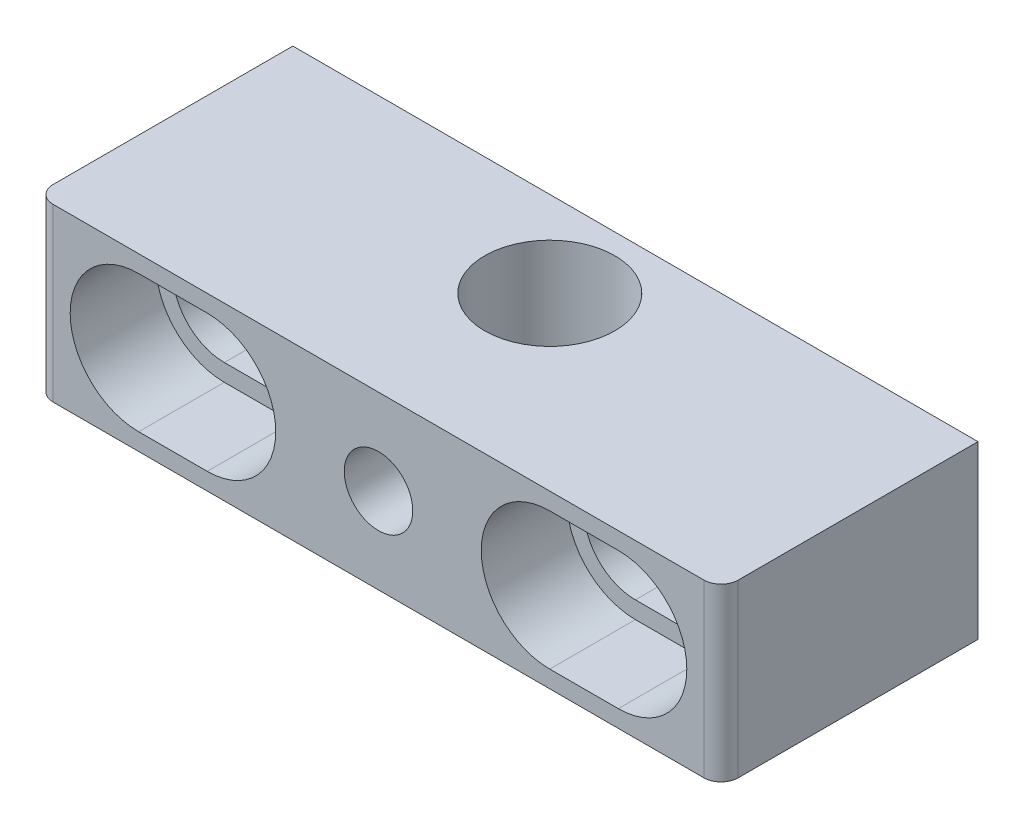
ISO-10303-21;
HEADER;
FILE_DESCRIPTION(('STEP AP214'),'2;1');
FILE_NAME('part.step','',(''),(''),'','','');
FILE_SCHEMA(('AUTOMOTIVE_DESIGN { 1 0 10303 214 1 1 1 1 }'));
ENDSEC;
DATA;
#1=APPLICATION_CONTEXT('core data for automotive mechanical design processes');
#2=APPLICATION_PROTOCOL_DEFINITION('international standard','automotive_design',2000,#1);
#3=PRODUCT_CONTEXT('',#1,'mechanical');
#4=PRODUCT('Part','Part','',(#3));
#5=PRODUCT_RELATED_PRODUCT_CATEGORY('part','',(#4));
#6=PRODUCT_DEFINITION_FORMATION('','',#4);
#7=PRODUCT_DEFINITION_CONTEXT('part definition',#1,'design');
#8=PRODUCT_DEFINITION('design','',#6,#7);
#9=PRODUCT_DEFINITION_SHAPE('','',#8);
#10=(LENGTH_UNIT() NAMED_UNIT(*) SI_UNIT(.MILLI.,.METRE.));
#11=(NAMED_UNIT(*) PLANE_ANGLE_UNIT() SI_UNIT($,.RADIAN.));
#12=(NAMED_UNIT(*) SI_UNIT($,.STERADIAN.) SOLID_ANGLE_UNIT());
#13=UNCERTAINTY_MEASURE_WITH_UNIT(LENGTH_MEASURE(1.E-05),#10,'distance_accuracy_value','');
#14=(GEOMETRIC_REPRESENTATION_CONTEXT(3) GLOBAL_UNCERTAINTY_ASSIGNED_CONTEXT((#13)) GLOBAL_UNIT_ASSIGNED_CONTEXT((#10,
#11,#12)) REPRESENTATION_CONTEXT('',''));
#15=CARTESIAN_POINT('',(0.,0.,0.));
#16=DIRECTION('',(0.,0.,1.));
#17=DIRECTION('',(1.,0.,0.));
#18=AXIS2_PLACEMENT_3D('',#15,#16,#17);
#19=CARTESIAN_POINT('',(0.,0.,6.35));
#20=DIRECTION('',(0.,0.,-1.));
#21=DIRECTION('',(-1.,0.,0.));
#22=AXIS2_PLACEMENT_3D('',#19,#20,#21);
#23=PLANE('',#22);
#24=CARTESIAN_POINT('',(0.,0.,6.35));
#25=DIRECTION('',(0.,0.,1.));
#26=DIRECTION('',(1.,0.,0.));
#27=AXIS2_PLACEMENT_3D('',#24,#25,#26);
#28=CIRCLE('',#27,2.54);
#29=CARTESIAN_POINT('',(2.54,0.,6.35));
#30=VERTEX_POINT('',#29);
#31=EDGE_CURVE('E667',#30,#30,#28,.T.);
#32=ORIENTED_EDGE('',*,*,#31,.F.);
#33=EDGE_LOOP('',(#32));
#34=FACE_BOUND('',#33,.T.);
#35=CARTESIAN_POINT('',(-17.78,0.,6.35));
#36=DIRECTION('',(0.,0.,1.));
#37=DIRECTION('',(1.,0.,0.));
#38=AXIS2_PLACEMENT_3D('',#35,#36,#37);
#39=CIRCLE('',#38,5.08);
#40=CARTESIAN_POINT('',(-17.78,5.08,6.35));
#41=VERTEX_POINT('',#40);
#42=CARTESIAN_POINT('',(-17.78,-5.08,6.35));
#43=VERTEX_POINT('',#42);
#44=EDGE_CURVE('E316',#41,#43,#39,.T.);
#45=ORIENTED_EDGE('',*,*,#44,.F.);
#46=DIRECTION('',(-1.,0.,0.));
#47=VECTOR('',#46,1.);
#48=CARTESIAN_POINT('',(-17.78,5.08,6.35));
#49=LINE('',#48,#47);
#50=CARTESIAN_POINT('',(-12.7,5.07999999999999,6.35));
#51=VERTEX_POINT('',#50);
#52=EDGE_CURVE('E324',#51,#41,#49,.T.);
#53=ORIENTED_EDGE('',*,*,#52,.F.);
#54=CARTESIAN_POINT('',(-12.7,0.,6.35));
#55=DIRECTION('',(0.,0.,1.));
#56=DIRECTION('',(1.,0.,0.));
#57=AXIS2_PLACEMENT_3D('',#54,#55,#56);
#58=CIRCLE('',#57,5.08);
#59=CARTESIAN_POINT('',(-12.7,-5.08,6.35));
#60=VERTEX_POINT('',#59);
#61=EDGE_CURVE('E321',#60,#51,#58,.T.);
#62=ORIENTED_EDGE('',*,*,#61,.F.);
#63=DIRECTION('',(1.,0.,0.));
#64=VECTOR('',#63,1.);
#65=CARTESIAN_POINT('',(-17.78,-5.08,6.35));
#66=LINE('',#65,#64);
#67=EDGE_CURVE('E318',#43,#60,#66,.T.);
#68=ORIENTED_EDGE('',*,*,#67,.F.);
#69=EDGE_LOOP('',(#45,#53,#62,#68));
#70=FACE_BOUND('',#69,.T.);
#71=DIRECTION('',(-1.,0.,0.));
#72=VECTOR('',#71,1.);
#73=CARTESIAN_POINT('',(-25.4,6.35,6.35));
#74=LINE('',#73,#72);
#75=CARTESIAN_POINT('',(24.13,6.35,6.35));
#76=VERTEX_POINT('',#75);
#77=CARTESIAN_POINT('',(-24.13,6.35,6.35));
#78=VERTEX_POINT('',#77);
#79=EDGE_CURVE('E345',#76,#78,#74,.T.);
#80=ORIENTED_EDGE('',*,*,#79,.T.);
#81=DIRECTION('',(0.,-1.,0.));
#82=VECTOR('',#81,1.);
#83=CARTESIAN_POINT('',(-24.13,0.,6.35));
#84=LINE('',#83,#82);
#85=CARTESIAN_POINT('',(-24.13,-6.35,6.35));
#86=VERTEX_POINT('',#85);
#87=EDGE_CURVE('E362',#78,#86,#84,.T.);
#88=ORIENTED_EDGE('',*,*,#87,.T.);
#89=DIRECTION('',(1.,0.,0.));
#90=VECTOR('',#89,1.);
#91=CARTESIAN_POINT('',(-25.4,-6.35,6.35));
#92=LINE('',#91,#90);
#93=CARTESIAN_POINT('',(24.13,-6.35,6.35));
#94=VERTEX_POINT('',#93);
#95=EDGE_CURVE('E348',#86,#94,#92,.T.);
#96=ORIENTED_EDGE('',*,*,#95,.T.);
#97=DIRECTION('',(0.,1.,0.));
#98=VECTOR('',#97,1.);
#99=CARTESIAN_POINT('',(24.13,0.,6.35));
#100=LINE('',#99,#98);
#101=EDGE_CURVE('E359',#94,#76,#100,.T.);
#102=ORIENTED_EDGE('',*,*,#101,.T.);
#103=EDGE_LOOP('',(#80,#88,#96,#102));
#104=FACE_BOUND('',#103,.T.);
#105=CARTESIAN_POINT('',(17.78,0.,6.35));
#106=DIRECTION('',(0.,0.,1.));
#107=DIRECTION('',(-1.,0.,0.));
#108=AXIS2_PLACEMENT_3D('',#105,#106,#107);
#109=CIRCLE('',#108,5.08);
#110=CARTESIAN_POINT('',(17.78,-5.08,6.35));
#111=VERTEX_POINT('',#110);
#112=CARTESIAN_POINT('',(17.78,5.08,6.35));
#113=VERTEX_POINT('',#112);
#114=EDGE_CURVE('E286',#111,#113,#109,.T.);
#115=ORIENTED_EDGE('',*,*,#114,.F.);
#116=DIRECTION('',(1.,0.,0.));
#117=VECTOR('',#116,1.);
#118=CARTESIAN_POINT('',(17.78,-5.08,6.35));
#119=LINE('',#118,#117);
#120=CARTESIAN_POINT('',(12.7,-5.08,6.35));
#121=VERTEX_POINT('',#120);
#122=EDGE_CURVE('E294',#121,#111,#119,.T.);
#123=ORIENTED_EDGE('',*,*,#122,.F.);
#124=CARTESIAN_POINT('',(12.7,0.,6.35));
#125=DIRECTION('',(0.,0.,1.));
#126=DIRECTION('',(-1.,0.,0.));
#127=AXIS2_PLACEMENT_3D('',#124,#125,#126);
#128=CIRCLE('',#127,5.08);
#129=CARTESIAN_POINT('',(12.7,5.07999999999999,6.35));
#130=VERTEX_POINT('',#129);
#131=EDGE_CURVE('E291',#130,#121,#128,.T.);
#132=ORIENTED_EDGE('',*,*,#131,.F.);
#133=DIRECTION('',(-1.,0.,0.));
#134=VECTOR('',#133,1.);
#135=CARTESIAN_POINT('',(17.78,5.08,6.35));
#136=LINE('',#135,#134);
#137=EDGE_CURVE('E288',#113,#130,#136,.T.);
#138=ORIENTED_EDGE('',*,*,#137,.F.);
#139=EDGE_LOOP('',(#115,#123,#132,#138));
#140=FACE_BOUND('',#139,.T.);
#141=ADVANCED_FACE('F44',(#34,#70,#104,#140),#23,.F.);
#142=CARTESIAN_POINT('',(25.4,-6.35,6.35));
#143=DIRECTION('',(-1.,0.,0.));
#144=DIRECTION('',(0.,0.,1.));
#145=AXIS2_PLACEMENT_3D('',#142,#143,#144);
#146=PLANE('',#145);
#147=DIRECTION('',(0.,0.,-1.));
#148=VECTOR('',#147,1.);
#149=CARTESIAN_POINT('',(25.4,6.35,6.35));
#150=LINE('',#149,#148);
#151=CARTESIAN_POINT('',(25.4,6.35,5.08));
#152=VERTEX_POINT('',#151);
#153=CARTESIAN_POINT('',(25.4,6.35,-12.7));
#154=VERTEX_POINT('',#153);
#155=EDGE_CURVE('E357',#152,#154,#150,.T.);
#156=ORIENTED_EDGE('',*,*,#155,.F.);
#157=DIRECTION('',(0.,1.,0.));
#158=VECTOR('',#157,1.);
#159=CARTESIAN_POINT('',(25.4,-6.35,5.08));
#160=LINE('',#159,#158);
#161=CARTESIAN_POINT('',(25.4,-6.35,5.08));
#162=VERTEX_POINT('',#161);
#163=EDGE_CURVE('E13',#152,#162,#160,.F.);
#164=ORIENTED_EDGE('',*,*,#163,.T.);
#165=DIRECTION('',(0.,0.,-1.));
#166=VECTOR('',#165,1.);
#167=CARTESIAN_POINT('',(25.4,-6.35,6.35));
#168=LINE('',#167,#166);
#169=CARTESIAN_POINT('',(25.4,-6.35,-12.7));
#170=VERTEX_POINT('',#169);
#171=EDGE_CURVE('E351',#162,#170,#168,.T.);
#172=ORIENTED_EDGE('',*,*,#171,.T.);
#173=DIRECTION('',(0.,-1.,0.));
#174=VECTOR('',#173,1.);
#175=CARTESIAN_POINT('',(25.4,-6.35,-12.7));
#176=LINE('',#175,#174);
#177=EDGE_CURVE('E279',#154,#170,#176,.T.);
#178=ORIENTED_EDGE('',*,*,#177,.F.);
#179=EDGE_LOOP('',(#156,#164,#172,#178));
#180=FACE_BOUND('',#179,.T.);
#181=ADVANCED_FACE('F393',(#180),#146,.F.);
#182=CARTESIAN_POINT('',(-25.4,6.35,6.35));
#183=DIRECTION('',(0.,-1.,0.));
#184=DIRECTION('',(0.,0.,-1.));
#185=AXIS2_PLACEMENT_3D('',#182,#183,#184);
#186=PLANE('',#185);
#187=CARTESIAN_POINT('',(0.,6.35,-6.35));
#188=DIRECTION('',(0.,1.,0.));
#189=DIRECTION('',(0.,0.,1.));
#190=AXIS2_PLACEMENT_3D('',#187,#188,#189);
#191=CIRCLE('',#190,4.826);
#192=CARTESIAN_POINT('',(0.,6.35,-1.524));
#193=VERTEX_POINT('',#192);
#194=EDGE_CURVE('E670',#193,#193,#191,.T.);
#195=ORIENTED_EDGE('',*,*,#194,.F.);
#196=EDGE_LOOP('',(#195));
#197=FACE_BOUND('',#196,.T.);
#198=DIRECTION('',(0.,0.,-1.));
#199=VECTOR('',#198,1.);
#200=CARTESIAN_POINT('',(-25.4,6.35,6.35));
#201=LINE('',#200,#199);
#202=CARTESIAN_POINT('',(-25.4,6.35,5.08));
#203=VERTEX_POINT('',#202);
#204=CARTESIAN_POINT('',(-25.4,6.35,-12.7));
#205=VERTEX_POINT('',#204);
#206=EDGE_CURVE('E355',#203,#205,#201,.T.);
#207=ORIENTED_EDGE('',*,*,#206,.F.);
#208=CARTESIAN_POINT('',(-24.13,6.35,5.08));
#209=DIRECTION('',(0.,-1.,0.));
#210=DIRECTION('',(0.,0.,-1.));
#211=AXIS2_PLACEMENT_3D('',#208,#209,#210);
#212=CIRCLE('',#211,1.27);
#213=EDGE_CURVE('E57',#203,#78,#212,.F.);
#214=ORIENTED_EDGE('',*,*,#213,.T.);
#215=ORIENTED_EDGE('',*,*,#79,.F.);
#216=CARTESIAN_POINT('',(24.13,6.35,5.08));
#217=DIRECTION('',(0.,-1.,0.));
#218=DIRECTION('',(0.,0.,-1.));
#219=AXIS2_PLACEMENT_3D('',#216,#217,#218);
#220=CIRCLE('',#219,1.27);
#221=EDGE_CURVE('E64',#76,#152,#220,.F.);
#222=ORIENTED_EDGE('',*,*,#221,.T.);
#223=ORIENTED_EDGE('',*,*,#155,.T.);
#224=DIRECTION('',(1.,0.,0.));
#225=VECTOR('',#224,1.);
#226=CARTESIAN_POINT('',(25.4,6.35,-12.7));
#227=LINE('',#226,#225);
#228=EDGE_CURVE('E276',#205,#154,#227,.T.);
#229=ORIENTED_EDGE('',*,*,#228,.F.);
#230=EDGE_LOOP('',(#207,#214,#215,#222,#223,#229));
#231=FACE_BOUND('',#230,.T.);
#232=ADVANCED_FACE('F372',(#197,#231),#186,.F.);
#233=CARTESIAN_POINT('',(-25.4,-6.35,6.35));
#234=DIRECTION('',(1.,0.,0.));
#235=DIRECTION('',(0.,0.,-1.));
#236=AXIS2_PLACEMENT_3D('',#233,#234,#235);
#237=PLANE('',#236);
#238=DIRECTION('',(0.,0.,-1.));
#239=VECTOR('',#238,1.);
#240=CARTESIAN_POINT('',(-25.4,-6.35,6.35));
#241=LINE('',#240,#239);
#242=CARTESIAN_POINT('',(-25.4,-6.35,5.08));
#243=VERTEX_POINT('',#242);
#244=CARTESIAN_POINT('',(-25.4,-6.35,-12.7));
#245=VERTEX_POINT('',#244);
#246=EDGE_CURVE('E353',#243,#245,#241,.T.);
#247=ORIENTED_EDGE('',*,*,#246,.F.);
#248=DIRECTION('',(0.,-1.,0.));
#249=VECTOR('',#248,1.);
#250=CARTESIAN_POINT('',(-25.4,-6.35,5.08));
#251=LINE('',#250,#249);
#252=EDGE_CURVE('E72',#243,#203,#251,.F.);
#253=ORIENTED_EDGE('',*,*,#252,.T.);
#254=ORIENTED_EDGE('',*,*,#206,.T.);
#255=DIRECTION('',(0.,1.,0.));
#256=VECTOR('',#255,1.);
#257=CARTESIAN_POINT('',(-25.4,-6.35,-12.7));
#258=LINE('',#257,#256);
#259=EDGE_CURVE('E273',#245,#205,#258,.T.);
#260=ORIENTED_EDGE('',*,*,#259,.F.);
#261=EDGE_LOOP('',(#247,#253,#254,#260));
#262=FACE_BOUND('',#261,.T.);
#263=ADVANCED_FACE('F385',(#262),#237,.F.);
#264=CARTESIAN_POINT('',(-25.4,-6.35,6.35));
#265=DIRECTION('',(0.,1.,0.));
#266=DIRECTION('',(0.,0.,1.));
#267=AXIS2_PLACEMENT_3D('',#264,#265,#266);
#268=PLANE('',#267);
#269=CARTESIAN_POINT('',(0.,-6.35,-6.35));
#270=DIRECTION('',(0.,1.,0.));
#271=DIRECTION('',(0.,0.,1.));
#272=AXIS2_PLACEMENT_3D('',#269,#270,#271);
#273=CIRCLE('',#272,4.826);
#274=CARTESIAN_POINT('',(0.,-6.35,-1.524));
#275=VERTEX_POINT('',#274);
#276=EDGE_CURVE('E232',#275,#275,#273,.T.);
#277=ORIENTED_EDGE('',*,*,#276,.T.);
#278=EDGE_LOOP('',(#277));
#279=FACE_BOUND('',#278,.T.);
#280=ORIENTED_EDGE('',*,*,#95,.F.);
#281=CARTESIAN_POINT('',(-24.13,-6.35,5.08));
#282=DIRECTION('',(0.,1.,0.));
#283=DIRECTION('',(0.,0.,1.));
#284=AXIS2_PLACEMENT_3D('',#281,#282,#283);
#285=CIRCLE('',#284,1.27);
#286=EDGE_CURVE('E367',#86,#243,#285,.F.);
#287=ORIENTED_EDGE('',*,*,#286,.T.);
#288=ORIENTED_EDGE('',*,*,#246,.T.);
#289=DIRECTION('',(-1.,0.,0.));
#290=VECTOR('',#289,1.);
#291=CARTESIAN_POINT('',(25.4,-6.35,-12.7));
#292=LINE('',#291,#290);
#293=EDGE_CURVE('E282',#170,#245,#292,.T.);
#294=ORIENTED_EDGE('',*,*,#293,.F.);
#295=ORIENTED_EDGE('',*,*,#171,.F.);
#296=CARTESIAN_POINT('',(24.13,-6.35,5.08));
#297=DIRECTION('',(0.,1.,0.));
#298=DIRECTION('',(0.,0.,1.));
#299=AXIS2_PLACEMENT_3D('',#296,#297,#298);
#300=CIRCLE('',#299,1.27);
#301=EDGE_CURVE('E365',#162,#94,#300,.F.);
#302=ORIENTED_EDGE('',*,*,#301,.T.);
#303=EDGE_LOOP('',(#280,#287,#288,#294,#295,#302));
#304=FACE_BOUND('',#303,.T.);
#305=ADVANCED_FACE('F382',(#279,#304),#268,.F.);
#306=CARTESIAN_POINT('',(-17.78,0.,6.35));
#307=DIRECTION('',(0.,0.,-1.));
#308=DIRECTION('',(-1.,0.,0.));
#309=AXIS2_PLACEMENT_3D('',#306,#307,#308);
#310=CYLINDRICAL_SURFACE('',#309,5.08);
#311=CARTESIAN_POINT('',(-17.78,0.,0.));
#312=DIRECTION('',(0.,0.,1.));
#313=DIRECTION('',(1.,0.,0.));
#314=AXIS2_PLACEMENT_3D('',#311,#312,#313);
#315=CIRCLE('',#314,5.08);
#316=CARTESIAN_POINT('',(-17.78,5.08,0.));
#317=VERTEX_POINT('',#316);
#318=CARTESIAN_POINT('',(-17.78,-5.08,0.));
#319=VERTEX_POINT('',#318);
#320=EDGE_CURVE('E315',#317,#319,#315,.T.);
#321=ORIENTED_EDGE('',*,*,#320,.F.);
#322=DIRECTION('',(0.,0.,-1.));
#323=VECTOR('',#322,1.);
#324=CARTESIAN_POINT('',(-17.78,5.08,6.35));
#325=LINE('',#324,#323);
#326=EDGE_CURVE('E326',#41,#317,#325,.T.);
#327=ORIENTED_EDGE('',*,*,#326,.F.);
#328=ORIENTED_EDGE('',*,*,#44,.T.);
#329=DIRECTION('',(0.,0.,-1.));
#330=VECTOR('',#329,1.);
#331=CARTESIAN_POINT('',(-17.78,-5.08,6.35));
#332=LINE('',#331,#330);
#333=EDGE_CURVE('E342',#43,#319,#332,.T.);
#334=ORIENTED_EDGE('',*,*,#333,.T.);
#335=EDGE_LOOP('',(#321,#327,#328,#334));
#336=FACE_BOUND('',#335,.T.);
#337=ADVANCED_FACE('F478',(#336),#310,.F.);
#338=CARTESIAN_POINT('',(-17.78,-5.08,6.35));
#339=DIRECTION('',(0.,1.,0.));
#340=DIRECTION('',(0.,0.,1.));
#341=AXIS2_PLACEMENT_3D('',#338,#339,#340);
#342=PLANE('',#341);
#343=DIRECTION('',(1.,0.,0.));
#344=VECTOR('',#343,1.);
#345=CARTESIAN_POINT('',(-17.78,-5.08,0.));
#346=LINE('',#345,#344);
#347=CARTESIAN_POINT('',(-12.7,-5.08,0.));
#348=VERTEX_POINT('',#347);
#349=EDGE_CURVE('E329',#319,#348,#346,.T.);
#350=ORIENTED_EDGE('',*,*,#349,.F.);
#351=ORIENTED_EDGE('',*,*,#333,.F.);
#352=ORIENTED_EDGE('',*,*,#67,.T.);
#353=DIRECTION('',(0.,0.,-1.));
#354=VECTOR('',#353,1.);
#355=CARTESIAN_POINT('',(-12.7,-5.08,6.35));
#356=LINE('',#355,#354);
#357=EDGE_CURVE('E340',#60,#348,#356,.T.);
#358=ORIENTED_EDGE('',*,*,#357,.T.);
#359=EDGE_LOOP('',(#350,#351,#352,#358));
#360=FACE_BOUND('',#359,.T.);
#361=ADVANCED_FACE('F474',(#360),#342,.T.);
#362=CARTESIAN_POINT('',(-12.7,0.,6.35));
#363=DIRECTION('',(0.,0.,-1.));
#364=DIRECTION('',(-1.,0.,0.));
#365=AXIS2_PLACEMENT_3D('',#362,#363,#364);
#366=CYLINDRICAL_SURFACE('',#365,5.08);
#367=CARTESIAN_POINT('',(-12.7,0.,0.));
#368=DIRECTION('',(0.,0.,1.));
#369=DIRECTION('',(1.,0.,0.));
#370=AXIS2_PLACEMENT_3D('',#367,#368,#369);
#371=CIRCLE('',#370,5.08);
#372=CARTESIAN_POINT('',(-12.7,5.07999999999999,0.));
#373=VERTEX_POINT('',#372);
#374=EDGE_CURVE('E332',#348,#373,#371,.T.);
#375=ORIENTED_EDGE('',*,*,#374,.F.);
#376=ORIENTED_EDGE('',*,*,#357,.F.);
#377=ORIENTED_EDGE('',*,*,#61,.T.);
#378=DIRECTION('',(0.,0.,-1.));
#379=VECTOR('',#378,1.);
#380=CARTESIAN_POINT('',(-12.7,5.07999999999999,6.35));
#381=LINE('',#380,#379);
#382=EDGE_CURVE('E338',#51,#373,#381,.T.);
#383=ORIENTED_EDGE('',*,*,#382,.T.);
#384=EDGE_LOOP('',(#375,#376,#377,#383));
#385=FACE_BOUND('',#384,.T.);
#386=ADVANCED_FACE('F470',(#385),#366,.F.);
#387=CARTESIAN_POINT('',(-17.78,5.08,6.35));
#388=DIRECTION('',(0.,-1.,0.));
#389=DIRECTION('',(1.,0.,0.));
#390=AXIS2_PLACEMENT_3D('',#387,#388,#389);
#391=PLANE('',#390);
#392=DIRECTION('',(-1.,0.,0.));
#393=VECTOR('',#392,1.);
#394=CARTESIAN_POINT('',(-17.78,5.08,0.));
#395=LINE('',#394,#393);
#396=EDGE_CURVE('E319',#373,#317,#395,.T.);
#397=ORIENTED_EDGE('',*,*,#396,.F.);
#398=ORIENTED_EDGE('',*,*,#382,.F.);
#399=ORIENTED_EDGE('',*,*,#52,.T.);
#400=ORIENTED_EDGE('',*,*,#326,.T.);
#401=EDGE_LOOP('',(#397,#398,#399,#400));
#402=FACE_BOUND('',#401,.T.);
#403=ADVANCED_FACE('F466',(#402),#391,.T.);
#404=CARTESIAN_POINT('',(17.78,0.,6.35));
#405=DIRECTION('',(0.,0.,-1.));
#406=DIRECTION('',(-1.,0.,0.));
#407=AXIS2_PLACEMENT_3D('',#404,#405,#406);
#408=CYLINDRICAL_SURFACE('',#407,5.08);
#409=CARTESIAN_POINT('',(17.78,0.,0.));
#410=DIRECTION('',(0.,0.,1.));
#411=DIRECTION('',(-1.,0.,0.));
#412=AXIS2_PLACEMENT_3D('',#409,#410,#411);
#413=CIRCLE('',#412,5.08);
#414=CARTESIAN_POINT('',(17.78,-5.08,0.));
#415=VERTEX_POINT('',#414);
#416=CARTESIAN_POINT('',(17.78,5.08,0.));
#417=VERTEX_POINT('',#416);
#418=EDGE_CURVE('E285',#415,#417,#413,.T.);
#419=ORIENTED_EDGE('',*,*,#418,.F.);
#420=DIRECTION('',(0.,0.,-1.));
#421=VECTOR('',#420,1.);
#422=CARTESIAN_POINT('',(17.78,-5.08,6.35));
#423=LINE('',#422,#421);
#424=EDGE_CURVE('E296',#111,#415,#423,.T.);
#425=ORIENTED_EDGE('',*,*,#424,.F.);
#426=ORIENTED_EDGE('',*,*,#114,.T.);
#427=DIRECTION('',(0.,0.,-1.));
#428=VECTOR('',#427,1.);
#429=CARTESIAN_POINT('',(17.78,5.08,6.35));
#430=LINE('',#429,#428);
#431=EDGE_CURVE('E312',#113,#417,#430,.T.);
#432=ORIENTED_EDGE('',*,*,#431,.T.);
#433=EDGE_LOOP('',(#419,#425,#426,#432));
#434=FACE_BOUND('',#433,.T.);
#435=ADVANCED_FACE('F462',(#434),#408,.F.);
#436=CARTESIAN_POINT('',(17.78,5.08,6.35));
#437=DIRECTION('',(0.,-1.,0.));
#438=DIRECTION('',(1.,0.,0.));
#439=AXIS2_PLACEMENT_3D('',#436,#437,#438);
#440=PLANE('',#439);
#441=DIRECTION('',(-1.,0.,0.));
#442=VECTOR('',#441,1.);
#443=CARTESIAN_POINT('',(17.78,5.08,0.));
#444=LINE('',#443,#442);
#445=CARTESIAN_POINT('',(12.7,5.07999999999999,0.));
#446=VERTEX_POINT('',#445);
#447=EDGE_CURVE('E299',#417,#446,#444,.T.);
#448=ORIENTED_EDGE('',*,*,#447,.F.);
#449=ORIENTED_EDGE('',*,*,#431,.F.);
#450=ORIENTED_EDGE('',*,*,#137,.T.);
#451=DIRECTION('',(0.,0.,-1.));
#452=VECTOR('',#451,1.);
#453=CARTESIAN_POINT('',(12.7,5.07999999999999,6.35));
#454=LINE('',#453,#452);
#455=EDGE_CURVE('E310',#130,#446,#454,.T.);
#456=ORIENTED_EDGE('',*,*,#455,.T.);
#457=EDGE_LOOP('',(#448,#449,#450,#456));
#458=FACE_BOUND('',#457,.T.);
#459=ADVANCED_FACE('F458',(#458),#440,.T.);
#460=CARTESIAN_POINT('',(12.7,0.,6.35));
#461=DIRECTION('',(0.,0.,-1.));
#462=DIRECTION('',(-1.,0.,0.));
#463=AXIS2_PLACEMENT_3D('',#460,#461,#462);
#464=CYLINDRICAL_SURFACE('',#463,5.08);
#465=CARTESIAN_POINT('',(12.7,0.,0.));
#466=DIRECTION('',(0.,0.,1.));
#467=DIRECTION('',(-1.,0.,0.));
#468=AXIS2_PLACEMENT_3D('',#465,#466,#467);
#469=CIRCLE('',#468,5.08);
#470=CARTESIAN_POINT('',(12.7,-5.08,0.));
#471=VERTEX_POINT('',#470);
#472=EDGE_CURVE('E302',#446,#471,#469,.T.);
#473=ORIENTED_EDGE('',*,*,#472,.F.);
#474=ORIENTED_EDGE('',*,*,#455,.F.);
#475=ORIENTED_EDGE('',*,*,#131,.T.);
#476=DIRECTION('',(0.,0.,-1.));
#477=VECTOR('',#476,1.);
#478=CARTESIAN_POINT('',(12.7,-5.08,6.35));
#479=LINE('',#478,#477);
#480=EDGE_CURVE('E308',#121,#471,#479,.T.);
#481=ORIENTED_EDGE('',*,*,#480,.T.);
#482=EDGE_LOOP('',(#473,#474,#475,#481));
#483=FACE_BOUND('',#482,.T.);
#484=ADVANCED_FACE('F454',(#483),#464,.F.);
#485=CARTESIAN_POINT('',(17.78,-5.08,6.35));
#486=DIRECTION('',(0.,1.,0.));
#487=DIRECTION('',(0.,0.,1.));
#488=AXIS2_PLACEMENT_3D('',#485,#486,#487);
#489=PLANE('',#488);
#490=DIRECTION('',(1.,0.,0.));
#491=VECTOR('',#490,1.);
#492=CARTESIAN_POINT('',(17.78,-5.08,0.));
#493=LINE('',#492,#491);
#494=EDGE_CURVE('E289',#471,#415,#493,.T.);
#495=ORIENTED_EDGE('',*,*,#494,.F.);
#496=ORIENTED_EDGE('',*,*,#480,.F.);
#497=ORIENTED_EDGE('',*,*,#122,.T.);
#498=ORIENTED_EDGE('',*,*,#424,.T.);
#499=EDGE_LOOP('',(#495,#496,#497,#498));
#500=FACE_BOUND('',#499,.T.);
#501=ADVANCED_FACE('F451',(#500),#489,.T.);
#502=CARTESIAN_POINT('',(0.,0.,0.));
#503=DIRECTION('',(0.,0.,1.));
#504=DIRECTION('',(1.,0.,0.));
#505=AXIS2_PLACEMENT_3D('',#502,#503,#504);
#506=PLANE('',#505);
#507=ORIENTED_EDGE('',*,*,#396,.T.);
#508=ORIENTED_EDGE('',*,*,#320,.T.);
#509=ORIENTED_EDGE('',*,*,#349,.T.);
#510=ORIENTED_EDGE('',*,*,#374,.T.);
#511=EDGE_LOOP('',(#507,#508,#509,#510));
#512=FACE_BOUND('',#511,.T.);
#513=DIRECTION('',(-1.,0.,0.));
#514=VECTOR('',#513,1.);
#515=CARTESIAN_POINT('',(-17.78,-3.81,0.));
#516=LINE('',#515,#514);
#517=CARTESIAN_POINT('',(-12.7,-3.81,0.));
#518=VERTEX_POINT('',#517);
#519=CARTESIAN_POINT('',(-17.78,-3.81,0.));
#520=VERTEX_POINT('',#519);
#521=EDGE_CURVE('E210',#518,#520,#516,.T.);
#522=ORIENTED_EDGE('',*,*,#521,.T.);
#523=CARTESIAN_POINT('',(-17.78,0.,0.));
#524=DIRECTION('',(0.,0.,-1.));
#525=DIRECTION('',(1.,0.,0.));
#526=AXIS2_PLACEMENT_3D('',#523,#524,#525);
#527=CIRCLE('',#526,3.81);
#528=CARTESIAN_POINT('',(-17.78,3.81,0.));
#529=VERTEX_POINT('',#528);
#530=EDGE_CURVE('E230',#520,#529,#527,.T.);
#531=ORIENTED_EDGE('',*,*,#530,.T.);
#532=DIRECTION('',(1.,0.,0.));
#533=VECTOR('',#532,1.);
#534=CARTESIAN_POINT('',(-17.78,3.81,0.));
#535=LINE('',#534,#533);
#536=CARTESIAN_POINT('',(-12.7,3.81,0.));
#537=VERTEX_POINT('',#536);
#538=EDGE_CURVE('E216',#529,#537,#535,.T.);
#539=ORIENTED_EDGE('',*,*,#538,.T.);
#540=CARTESIAN_POINT('',(-12.7,0.,0.));
#541=DIRECTION('',(0.,0.,-1.));
#542=DIRECTION('',(1.,0.,0.));
#543=AXIS2_PLACEMENT_3D('',#540,#541,#542);
#544=CIRCLE('',#543,3.81);
#545=EDGE_CURVE('E234',#537,#518,#544,.T.);
#546=ORIENTED_EDGE('',*,*,#545,.T.);
#547=EDGE_LOOP('',(#522,#531,#539,#546));
#548=FACE_BOUND('',#547,.T.);
#549=ADVANCED_FACE('F446',(#512,#548),#506,.T.);
#550=CARTESIAN_POINT('',(0.,0.,-12.7));
#551=DIRECTION('',(0.,0.,1.));
#552=DIRECTION('',(1.,0.,0.));
#553=AXIS2_PLACEMENT_3D('',#550,#551,#552);
#554=PLANE('',#553);
#555=CARTESIAN_POINT('',(17.78,0.,-12.7));
#556=DIRECTION('',(0.,0.,-1.));
#557=DIRECTION('',(-1.,0.,0.));
#558=AXIS2_PLACEMENT_3D('',#555,#556,#557);
#559=CIRCLE('',#558,3.81);
#560=CARTESIAN_POINT('',(17.78,3.81,-12.7));
#561=VERTEX_POINT('',#560);
#562=CARTESIAN_POINT('',(17.78,-3.81,-12.7));
#563=VERTEX_POINT('',#562);
#564=EDGE_CURVE('E243',#561,#563,#559,.T.);
#565=ORIENTED_EDGE('',*,*,#564,.F.);
#566=DIRECTION('',(1.,0.,0.));
#567=VECTOR('',#566,1.);
#568=CARTESIAN_POINT('',(17.78,3.81,-12.7));
#569=LINE('',#568,#567);
#570=CARTESIAN_POINT('',(12.7,3.81,-12.7));
#571=VERTEX_POINT('',#570);
#572=EDGE_CURVE('E251',#571,#561,#569,.T.);
#573=ORIENTED_EDGE('',*,*,#572,.F.);
#574=CARTESIAN_POINT('',(12.7,0.,-12.7));
#575=DIRECTION('',(0.,0.,-1.));
#576=DIRECTION('',(-1.,0.,0.));
#577=AXIS2_PLACEMENT_3D('',#574,#575,#576);
#578=CIRCLE('',#577,3.81);
#579=CARTESIAN_POINT('',(12.7,-3.81,-12.7));
#580=VERTEX_POINT('',#579);
#581=EDGE_CURVE('E248',#580,#571,#578,.T.);
#582=ORIENTED_EDGE('',*,*,#581,.F.);
#583=DIRECTION('',(-1.,0.,0.));
#584=VECTOR('',#583,1.);
#585=CARTESIAN_POINT('',(17.78,-3.81,-12.7));
#586=LINE('',#585,#584);
#587=EDGE_CURVE('E245',#563,#580,#586,.T.);
#588=ORIENTED_EDGE('',*,*,#587,.F.);
#589=EDGE_LOOP('',(#565,#573,#582,#588));
#590=FACE_BOUND('',#589,.T.);
#591=ORIENTED_EDGE('',*,*,#259,.T.);
#592=ORIENTED_EDGE('',*,*,#228,.T.);
#593=ORIENTED_EDGE('',*,*,#177,.T.);
#594=ORIENTED_EDGE('',*,*,#293,.T.);
#595=EDGE_LOOP('',(#591,#592,#593,#594));
#596=FACE_BOUND('',#595,.T.);
#597=CARTESIAN_POINT('',(-17.78,0.,-12.7));
#598=DIRECTION('',(0.,0.,-1.));
#599=DIRECTION('',(1.,0.,0.));
#600=AXIS2_PLACEMENT_3D('',#597,#598,#599);
#601=CIRCLE('',#600,3.81);
#602=CARTESIAN_POINT('',(-17.78,-3.81,-12.7));
#603=VERTEX_POINT('',#602);
#604=CARTESIAN_POINT('',(-17.78,3.81,-12.7));
#605=VERTEX_POINT('',#604);
#606=EDGE_CURVE('E199',#603,#605,#601,.T.);
#607=ORIENTED_EDGE('',*,*,#606,.F.);
#608=DIRECTION('',(-1.,0.,0.));
#609=VECTOR('',#608,1.);
#610=CARTESIAN_POINT('',(-17.78,-3.81,-12.7));
#611=LINE('',#610,#609);
#612=CARTESIAN_POINT('',(-12.7,-3.81,-12.7));
#613=VERTEX_POINT('',#612);
#614=EDGE_CURVE('E225',#613,#603,#611,.T.);
#615=ORIENTED_EDGE('',*,*,#614,.F.);
#616=CARTESIAN_POINT('',(-12.7,0.,-12.7));
#617=DIRECTION('',(0.,0.,-1.));
#618=DIRECTION('',(1.,0.,0.));
#619=AXIS2_PLACEMENT_3D('',#616,#617,#618);
#620=CIRCLE('',#619,3.81);
#621=CARTESIAN_POINT('',(-12.7,3.81,-12.7));
#622=VERTEX_POINT('',#621);
#623=EDGE_CURVE('E223',#622,#613,#620,.T.);
#624=ORIENTED_EDGE('',*,*,#623,.F.);
#625=DIRECTION('',(1.,0.,0.));
#626=VECTOR('',#625,1.);
#627=CARTESIAN_POINT('',(-17.78,3.81,-12.7));
#628=LINE('',#627,#626);
#629=EDGE_CURVE('E209',#605,#622,#628,.T.);
#630=ORIENTED_EDGE('',*,*,#629,.F.);
#631=EDGE_LOOP('',(#607,#615,#624,#630));
#632=FACE_BOUND('',#631,.T.);
#633=ADVANCED_FACE('F221',(#590,#596,#632),#554,.F.);
#634=ORIENTED_EDGE('',*,*,#494,.T.);
#635=ORIENTED_EDGE('',*,*,#418,.T.);
#636=ORIENTED_EDGE('',*,*,#447,.T.);
#637=ORIENTED_EDGE('',*,*,#472,.T.);
#638=EDGE_LOOP('',(#634,#635,#636,#637));
#639=FACE_BOUND('',#638,.T.);
#640=DIRECTION('',(1.,0.,0.));
#641=VECTOR('',#640,1.);
#642=CARTESIAN_POINT('',(17.78,3.81,0.));
#643=LINE('',#642,#641);
#644=CARTESIAN_POINT('',(12.7,3.81,0.));
#645=VERTEX_POINT('',#644);
#646=CARTESIAN_POINT('',(17.78,3.81,0.));
#647=VERTEX_POINT('',#646);
#648=EDGE_CURVE('E246',#645,#647,#643,.T.);
#649=ORIENTED_EDGE('',*,*,#648,.T.);
#650=CARTESIAN_POINT('',(17.78,0.,0.));
#651=DIRECTION('',(0.,0.,-1.));
#652=DIRECTION('',(-1.,0.,0.));
#653=AXIS2_PLACEMENT_3D('',#650,#651,#652);
#654=CIRCLE('',#653,3.81);
#655=CARTESIAN_POINT('',(17.78,-3.81,0.));
#656=VERTEX_POINT('',#655);
#657=EDGE_CURVE('E217',#647,#656,#654,.T.);
#658=ORIENTED_EDGE('',*,*,#657,.T.);
#659=DIRECTION('',(-1.,0.,0.));
#660=VECTOR('',#659,1.);
#661=CARTESIAN_POINT('',(17.78,-3.81,0.));
#662=LINE('',#661,#660);
#663=CARTESIAN_POINT('',(12.7,-3.81,0.));
#664=VERTEX_POINT('',#663);
#665=EDGE_CURVE('E256',#656,#664,#662,.T.);
#666=ORIENTED_EDGE('',*,*,#665,.T.);
#667=CARTESIAN_POINT('',(12.7,0.,0.));
#668=DIRECTION('',(0.,0.,-1.));
#669=DIRECTION('',(-1.,0.,0.));
#670=AXIS2_PLACEMENT_3D('',#667,#668,#669);
#671=CIRCLE('',#670,3.81);
#672=EDGE_CURVE('E259',#664,#645,#671,.T.);
#673=ORIENTED_EDGE('',*,*,#672,.T.);
#674=EDGE_LOOP('',(#649,#658,#666,#673));
#675=FACE_BOUND('',#674,.T.);
#676=ADVANCED_FACE('F442',(#639,#675),#506,.T.);
#677=CARTESIAN_POINT('',(17.78,0.,-12.7));
#678=DIRECTION('',(0.,0.,1.));
#679=DIRECTION('',(1.,0.,0.));
#680=AXIS2_PLACEMENT_3D('',#677,#678,#679);
#681=CYLINDRICAL_SURFACE('',#680,3.81);
#682=ORIENTED_EDGE('',*,*,#657,.F.);
#683=DIRECTION('',(0.,0.,1.));
#684=VECTOR('',#683,1.);
#685=CARTESIAN_POINT('',(17.78,3.81,-12.7));
#686=LINE('',#685,#684);
#687=EDGE_CURVE('E253',#561,#647,#686,.T.);
#688=ORIENTED_EDGE('',*,*,#687,.F.);
#689=ORIENTED_EDGE('',*,*,#564,.T.);
#690=DIRECTION('',(0.,0.,1.));
#691=VECTOR('',#690,1.);
#692=CARTESIAN_POINT('',(17.78,-3.81,-12.7));
#693=LINE('',#692,#691);
#694=EDGE_CURVE('E270',#563,#656,#693,.T.);
#695=ORIENTED_EDGE('',*,*,#694,.T.);
#696=EDGE_LOOP('',(#682,#688,#689,#695));
#697=FACE_BOUND('',#696,.T.);
#698=ADVANCED_FACE('F438',(#697),#681,.F.);
#699=CARTESIAN_POINT('',(17.78,-3.81,-12.7));
#700=DIRECTION('',(0.,1.,0.));
#701=DIRECTION('',(-1.,0.,0.));
#702=AXIS2_PLACEMENT_3D('',#699,#700,#701);
#703=PLANE('',#702);
#704=ORIENTED_EDGE('',*,*,#665,.F.);
#705=ORIENTED_EDGE('',*,*,#694,.F.);
#706=ORIENTED_EDGE('',*,*,#587,.T.);
#707=DIRECTION('',(0.,0.,1.));
#708=VECTOR('',#707,1.);
#709=CARTESIAN_POINT('',(12.7,-3.81,-12.7));
#710=LINE('',#709,#708);
#711=EDGE_CURVE('E268',#580,#664,#710,.T.);
#712=ORIENTED_EDGE('',*,*,#711,.T.);
#713=EDGE_LOOP('',(#704,#705,#706,#712));
#714=FACE_BOUND('',#713,.T.);
#715=ADVANCED_FACE('F434',(#714),#703,.T.);
#716=CARTESIAN_POINT('',(12.7,0.,-12.7));
#717=DIRECTION('',(0.,0.,1.));
#718=DIRECTION('',(1.,0.,0.));
#719=AXIS2_PLACEMENT_3D('',#716,#717,#718);
#720=CYLINDRICAL_SURFACE('',#719,3.81);
#721=ORIENTED_EDGE('',*,*,#672,.F.);
#722=ORIENTED_EDGE('',*,*,#711,.F.);
#723=ORIENTED_EDGE('',*,*,#581,.T.);
#724=DIRECTION('',(0.,0.,1.));
#725=VECTOR('',#724,1.);
#726=CARTESIAN_POINT('',(12.7,3.81,-12.7));
#727=LINE('',#726,#725);
#728=EDGE_CURVE('E266',#571,#645,#727,.T.);
#729=ORIENTED_EDGE('',*,*,#728,.T.);
#730=EDGE_LOOP('',(#721,#722,#723,#729));
#731=FACE_BOUND('',#730,.T.);
#732=ADVANCED_FACE('F430',(#731),#720,.F.);
#733=CARTESIAN_POINT('',(17.78,3.81,-12.7));
#734=DIRECTION('',(0.,-1.,0.));
#735=DIRECTION('',(1.,0.,0.));
#736=AXIS2_PLACEMENT_3D('',#733,#734,#735);
#737=PLANE('',#736);
#738=ORIENTED_EDGE('',*,*,#648,.F.);
#739=ORIENTED_EDGE('',*,*,#728,.F.);
#740=ORIENTED_EDGE('',*,*,#572,.T.);
#741=ORIENTED_EDGE('',*,*,#687,.T.);
#742=EDGE_LOOP('',(#738,#739,#740,#741));
#743=FACE_BOUND('',#742,.T.);
#744=ADVANCED_FACE('F427',(#743),#737,.T.);
#745=CARTESIAN_POINT('',(-17.78,0.,-12.7));
#746=DIRECTION('',(0.,0.,1.));
#747=DIRECTION('',(1.,0.,0.));
#748=AXIS2_PLACEMENT_3D('',#745,#746,#747);
#749=CYLINDRICAL_SURFACE('',#748,3.81);
#750=ORIENTED_EDGE('',*,*,#530,.F.);
#751=DIRECTION('',(0.,0.,1.));
#752=VECTOR('',#751,1.);
#753=CARTESIAN_POINT('',(-17.78,-3.81,-12.7));
#754=LINE('',#753,#752);
#755=EDGE_CURVE('E205',#603,#520,#754,.T.);
#756=ORIENTED_EDGE('',*,*,#755,.F.);
#757=ORIENTED_EDGE('',*,*,#606,.T.);
#758=DIRECTION('',(0.,0.,1.));
#759=VECTOR('',#758,1.);
#760=CARTESIAN_POINT('',(-17.78,3.81,-12.7));
#761=LINE('',#760,#759);
#762=EDGE_CURVE('E202',#605,#529,#761,.T.);
#763=ORIENTED_EDGE('',*,*,#762,.T.);
#764=EDGE_LOOP('',(#750,#756,#757,#763));
#765=FACE_BOUND('',#764,.T.);
#766=ADVANCED_FACE('F201',(#765),#749,.F.);
#767=CARTESIAN_POINT('',(-17.78,3.81,-12.7));
#768=DIRECTION('',(0.,-1.,0.));
#769=DIRECTION('',(1.,0.,0.));
#770=AXIS2_PLACEMENT_3D('',#767,#768,#769);
#771=PLANE('',#770);
#772=ORIENTED_EDGE('',*,*,#538,.F.);
#773=ORIENTED_EDGE('',*,*,#762,.F.);
#774=ORIENTED_EDGE('',*,*,#629,.T.);
#775=DIRECTION('',(0.,0.,1.));
#776=VECTOR('',#775,1.);
#777=CARTESIAN_POINT('',(-12.7,3.81,-12.7));
#778=LINE('',#777,#776);
#779=EDGE_CURVE('E218',#622,#537,#778,.T.);
#780=ORIENTED_EDGE('',*,*,#779,.T.);
#781=EDGE_LOOP('',(#772,#773,#774,#780));
#782=FACE_BOUND('',#781,.T.);
#783=ADVANCED_FACE('F213',(#782),#771,.T.);
#784=CARTESIAN_POINT('',(-12.7,0.,-12.7));
#785=DIRECTION('',(0.,0.,1.));
#786=DIRECTION('',(1.,0.,0.));
#787=AXIS2_PLACEMENT_3D('',#784,#785,#786);
#788=CYLINDRICAL_SURFACE('',#787,3.81);
#789=ORIENTED_EDGE('',*,*,#545,.F.);
#790=ORIENTED_EDGE('',*,*,#779,.F.);
#791=ORIENTED_EDGE('',*,*,#623,.T.);
#792=DIRECTION('',(0.,0.,1.));
#793=VECTOR('',#792,1.);
#794=CARTESIAN_POINT('',(-12.7,-3.81,-12.7));
#795=LINE('',#794,#793);
#796=EDGE_CURVE('E240',#613,#518,#795,.T.);
#797=ORIENTED_EDGE('',*,*,#796,.T.);
#798=EDGE_LOOP('',(#789,#790,#791,#797));
#799=FACE_BOUND('',#798,.T.);
#800=ADVANCED_FACE('F412',(#799),#788,.F.);
#801=CARTESIAN_POINT('',(-17.78,-3.81,-12.7));
#802=DIRECTION('',(0.,1.,0.));
#803=DIRECTION('',(-1.,0.,0.));
#804=AXIS2_PLACEMENT_3D('',#801,#802,#803);
#805=PLANE('',#804);
#806=ORIENTED_EDGE('',*,*,#521,.F.);
#807=ORIENTED_EDGE('',*,*,#796,.F.);
#808=ORIENTED_EDGE('',*,*,#614,.T.);
#809=ORIENTED_EDGE('',*,*,#755,.T.);
#810=EDGE_LOOP('',(#806,#807,#808,#809));
#811=FACE_BOUND('',#810,.T.);
#812=ADVANCED_FACE('F406',(#811),#805,.T.);
#813=CARTESIAN_POINT('',(-24.13,0.,5.08));
#814=DIRECTION('',(0.,-1.,0.));
#815=DIRECTION('',(0.,0.,-1.));
#816=AXIS2_PLACEMENT_3D('',#813,#814,#815);
#817=CYLINDRICAL_SURFACE('',#816,1.27);
#818=ORIENTED_EDGE('',*,*,#213,.F.);
#819=ORIENTED_EDGE('',*,*,#252,.F.);
#820=ORIENTED_EDGE('',*,*,#286,.F.);
#821=ORIENTED_EDGE('',*,*,#87,.F.);
#822=EDGE_LOOP('',(#818,#819,#820,#821));
#823=FACE_BOUND('',#822,.T.);
#824=ADVANCED_FACE('F380',(#823),#817,.T.);
#825=CARTESIAN_POINT('',(24.13,0.,5.08));
#826=DIRECTION('',(0.,1.,0.));
#827=DIRECTION('',(0.,0.,1.));
#828=AXIS2_PLACEMENT_3D('',#825,#826,#827);
#829=CYLINDRICAL_SURFACE('',#828,1.27);
#830=ORIENTED_EDGE('',*,*,#301,.F.);
#831=ORIENTED_EDGE('',*,*,#163,.F.);
#832=ORIENTED_EDGE('',*,*,#221,.F.);
#833=ORIENTED_EDGE('',*,*,#101,.F.);
#834=EDGE_LOOP('',(#830,#831,#832,#833));
#835=FACE_BOUND('',#834,.T.);
#836=ADVANCED_FACE('F46',(#835),#829,.T.);
#837=CARTESIAN_POINT('',(0.,-6.35,-6.35));
#838=DIRECTION('',(0.,1.,0.));
#839=DIRECTION('',(0.,0.,1.));
#840=AXIS2_PLACEMENT_3D('',#837,#838,#839);
#841=CYLINDRICAL_SURFACE('',#840,4.826);
#842=CARTESIAN_POINT('',(0.,-2.54,-1.524));
#843=CARTESIAN_POINT('',(0.132671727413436,-2.53998970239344,-1.5240089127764));
#844=CARTESIAN_POINT('',(0.265481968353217,-2.52954357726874,-1.52952874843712));
#845=CARTESIAN_POINT('',(0.527119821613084,-2.48824304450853,-1.55106967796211));
#846=CARTESIAN_POINT('',(0.655940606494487,-2.45735547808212,-1.56710783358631));
#847=CARTESIAN_POINT('',(0.905431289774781,-2.37674403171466,-1.6080183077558));
#848=CARTESIAN_POINT('',(1.02613165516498,-2.32709578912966,-1.63285512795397));
#849=CARTESIAN_POINT('',(1.25727953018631,-2.21079285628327,-1.68913136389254));
#850=CARTESIAN_POINT('',(1.36772716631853,-2.14413837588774,-1.72057069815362));
#851=CARTESIAN_POINT('',(1.5832989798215,-1.99082406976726,-1.78961976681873));
#852=CARTESIAN_POINT('',(1.68761176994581,-1.90314624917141,-1.82749761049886));
#853=CARTESIAN_POINT('',(1.88081258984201,-1.71247923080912,-1.90436704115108));
#854=CARTESIAN_POINT('',(1.96968749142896,-1.60947713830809,-1.9433595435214));
#855=CARTESIAN_POINT('',(2.1373780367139,-1.38026510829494,-2.02204388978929));
#856=CARTESIAN_POINT('',(2.21461446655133,-1.25280939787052,-2.06149393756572));
#857=CARTESIAN_POINT('',(2.34625321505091,-0.984350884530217,-2.1320620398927));
#858=CARTESIAN_POINT('',(2.40067294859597,-0.843358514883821,-2.16318644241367));
#859=CARTESIAN_POINT('',(2.46182491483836,-0.629364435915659,-2.19907345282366));
#860=CARTESIAN_POINT('',(2.47854123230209,-0.559963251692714,-2.20906245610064));
#861=CARTESIAN_POINT('',(2.50611551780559,-0.41962701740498,-2.2256909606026));
#862=CARTESIAN_POINT('',(2.51697676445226,-0.348692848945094,-2.23233233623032));
#863=CARTESIAN_POINT('',(2.53265234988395,-0.205965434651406,-2.24195494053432));
#864=CARTESIAN_POINT('',(2.53747134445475,-0.134172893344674,-2.2449389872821));
#865=CARTESIAN_POINT('',(2.54100092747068,0.00959608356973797,-2.24712440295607));
#866=CARTESIAN_POINT('',(2.539712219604,0.0815724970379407,-2.24632620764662));
#867=CARTESIAN_POINT('',(2.52787067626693,0.277161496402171,-2.23900653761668));
#868=CARTESIAN_POINT('',(2.51127256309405,0.400333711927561,-2.22875143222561));
#869=CARTESIAN_POINT('',(2.46070324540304,0.641710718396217,-2.19836753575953));
#870=CARTESIAN_POINT('',(2.42672539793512,0.759913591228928,-2.1782349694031));
#871=CARTESIAN_POINT('',(2.34182911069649,0.991456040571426,-2.12998378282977));
#872=CARTESIAN_POINT('',(2.29054297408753,1.10462387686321,-2.10169395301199));
#873=CARTESIAN_POINT('',(2.17277977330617,1.32130894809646,-2.04027741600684));
#874=CARTESIAN_POINT('',(2.10629593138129,1.42482184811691,-2.00714855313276));
#875=CARTESIAN_POINT('',(1.94900130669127,1.63479698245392,-1.93409595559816));
#876=CARTESIAN_POINT('',(1.85607382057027,1.73957678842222,-1.89387674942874));
#877=CARTESIAN_POINT('',(1.65390878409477,1.93280964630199,-1.81495390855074));
#878=CARTESIAN_POINT('',(1.54466182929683,2.0212532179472,-1.77625116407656));
#879=CARTESIAN_POINT('',(1.30519956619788,2.18407094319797,-1.70206575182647));
#880=CARTESIAN_POINT('',(1.17414752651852,2.25736570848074,-1.66688924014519));
#881=CARTESIAN_POINT('',(0.899262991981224,2.38023808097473,-1.60644258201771));
#882=CARTESIAN_POINT('',(0.755441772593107,2.4298363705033,-1.5811638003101));
#883=CARTESIAN_POINT('',(0.47272266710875,2.49948333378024,-1.54528472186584));
#884=CARTESIAN_POINT('',(0.334514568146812,2.52175772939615,-1.53358383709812));
#885=CARTESIAN_POINT('',(0.055852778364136,2.54322137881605,-1.5223134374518));
#886=CARTESIAN_POINT('',(-0.0845996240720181,2.5424234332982,-1.52273719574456));
#887=CARTESIAN_POINT('',(-0.350603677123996,2.51891467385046,-1.53507199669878));
#888=CARTESIAN_POINT('',(-0.476380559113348,2.49813470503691,-1.54597079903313));
#889=CARTESIAN_POINT('',(-0.72236984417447,2.43840228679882,-1.57675915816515));
#890=CARTESIAN_POINT('',(-0.842581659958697,2.39944792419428,-1.59664966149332));
#891=CARTESIAN_POINT('',(-1.07768192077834,2.30363604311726,-1.64429637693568));
#892=CARTESIAN_POINT('',(-1.19235248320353,2.2463418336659,-1.67224259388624));
#893=CARTESIAN_POINT('',(-1.41079460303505,2.11599988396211,-1.73341884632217));
#894=CARTESIAN_POINT('',(-1.51456178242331,2.04294585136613,-1.76665099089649));
#895=CARTESIAN_POINT('',(-1.71992089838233,1.87428532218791,-1.83943100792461));
#896=CARTESIAN_POINT('',(-1.82012168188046,1.7771106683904,-1.87927511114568));
#897=CARTESIAN_POINT('',(-2.00349303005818,1.56749253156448,-1.95838464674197));
#898=CARTESIAN_POINT('',(-2.0866486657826,1.4550358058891,-1.99764954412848));
#899=CARTESIAN_POINT('',(-2.23863312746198,1.20924909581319,-2.07373126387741));
#900=CARTESIAN_POINT('',(-2.30622622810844,1.07504960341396,-2.11023709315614));
#901=CARTESIAN_POINT('',(-2.41716789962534,0.794695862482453,-2.17247998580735));
#902=CARTESIAN_POINT('',(-2.46055046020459,0.648558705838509,-2.19823213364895));
#903=CARTESIAN_POINT('',(-2.51760249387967,0.363675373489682,-2.23260191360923));
#904=CARTESIAN_POINT('',(-2.53376580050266,0.2256069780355,-2.24265060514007));
#905=CARTESIAN_POINT('',(-2.54325251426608,-0.0515809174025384,-2.24851336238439));
#906=CARTESIAN_POINT('',(-2.53659006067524,-0.190699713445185,-2.2443362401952));
#907=CARTESIAN_POINT('',(-2.50300230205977,-0.448951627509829,-2.22379698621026));
#908=CARTESIAN_POINT('',(-2.47851068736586,-0.568534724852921,-2.20890063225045));
#909=CARTESIAN_POINT('',(-2.41320402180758,-0.801694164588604,-2.17050857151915));
#910=CARTESIAN_POINT('',(-2.37238313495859,-0.915268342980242,-2.14700979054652));
#911=CARTESIAN_POINT('',(-2.27264506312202,-1.1414706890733,-2.09220845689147));
#912=CARTESIAN_POINT('',(-2.21271932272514,-1.25355163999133,-2.06049617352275));
#913=CARTESIAN_POINT('',(-2.07750163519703,-1.46681674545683,-1.99340018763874));
#914=CARTESIAN_POINT('',(-2.00220141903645,-1.56799499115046,-1.95801451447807));
#915=CARTESIAN_POINT('',(-1.82607748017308,-1.77131408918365,-1.88165052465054));
#916=CARTESIAN_POINT('',(-1.72315801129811,-1.87161677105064,-1.84058119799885));
#917=CARTESIAN_POINT('',(-1.50105472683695,-2.05404906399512,-1.76186109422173));
#918=CARTESIAN_POINT('',(-1.38186088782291,-2.13616739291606,-1.7242124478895));
#919=CARTESIAN_POINT('',(-1.12690740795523,-2.2811267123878,-1.65553063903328));
#920=CARTESIAN_POINT('',(-0.99086185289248,-2.34354494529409,-1.62464641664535));
#921=CARTESIAN_POINT('',(-0.779091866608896,-2.41872771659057,-1.58675842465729));
#922=CARTESIAN_POINT('',(-0.707266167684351,-2.4407064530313,-1.57553992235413));
#923=CARTESIAN_POINT('',(-0.561569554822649,-2.47828286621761,-1.55622304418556));
#924=CARTESIAN_POINT('',(-0.487699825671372,-2.49388416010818,-1.54812289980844));
#925=CARTESIAN_POINT('',(-0.345056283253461,-2.51739912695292,-1.53586632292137));
#926=CARTESIAN_POINT('',(-0.276396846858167,-2.52586263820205,-1.53142855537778));
#927=CARTESIAN_POINT('',(-0.138504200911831,-2.53716581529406,-1.52549303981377));
#928=CARTESIAN_POINT('',(-0.0692709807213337,-2.54000537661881,-1.52399534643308));
#929=CARTESIAN_POINT('',(0.,-2.54,-1.524));
#930=B_SPLINE_CURVE_WITH_KNOTS('',3,(#842,#843,#844,#845,#846,#847,#848,#849,#850,#851,#852,
#853,#854,#855,#856,#857,#858,#859,#860,#861,#862,#863,#864,#865,#866,#867,#868,#869,#870,#871,
#872,#873,#874,#875,#876,#877,#878,#879,#880,#881,#882,#883,#884,#885,#886,#887,#888,#889,#890,
#891,#892,#893,#894,#895,#896,#897,#898,#899,#900,#901,#902,#903,#904,#905,#906,#907,#908,#909,
#910,#911,#912,#913,#914,#915,#916,#917,#918,#919,#920,#921,#922,#923,#924,#925,#926,#927,#928,
#929),.UNSPECIFIED.,.T.,.F.,(4,2,2,2,2,2,2,2,2,2,2,2,2,2,2,2,2,2,2,2,2,2,2,2,2,2,2,2,2,2,2,2,2,
2,2,2,2,2,2,2,2,2,2,4),(0.,0.397746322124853,0.796139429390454,1.19294318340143,
1.58974204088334,2.01230703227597,2.43522962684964,2.89546398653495,3.35534642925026,
3.57131730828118,3.78716712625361,4.0028505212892,4.21850906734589,4.59069978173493,
4.96303286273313,5.34383371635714,5.72480472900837,6.16007486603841,6.59559681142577,
7.05576432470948,7.51552946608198,7.93462648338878,8.35349098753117,8.73556505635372,
9.11767935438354,9.50966949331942,9.90181643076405,10.3354440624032,10.7694498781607,
11.230852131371,11.6916049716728,12.1072345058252,12.5226066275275,12.8899184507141,
13.2573616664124,13.6488257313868,14.0405008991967,14.4868650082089,14.9335052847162,
15.3891646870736,15.6167064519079,15.8441189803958,16.0517876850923,16.259460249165),.UNSPECIFIED.);
#931=CARTESIAN_POINT('',(0.,-2.54,-1.524));
#932=VERTEX_POINT('',#931);
#933=EDGE_CURVE('E48',#932,#932,#930,.T.);
#934=ORIENTED_EDGE('',*,*,#933,.T.);
#935=EDGE_LOOP('',(#934));
#936=FACE_BOUND('',#935,.T.);
#937=ORIENTED_EDGE('',*,*,#276,.F.);
#938=EDGE_LOOP('',(#937));
#939=FACE_BOUND('',#938,.T.);
#940=ORIENTED_EDGE('',*,*,#194,.T.);
#941=EDGE_LOOP('',(#940));
#942=FACE_BOUND('',#941,.T.);
#943=ADVANCED_FACE('F411',(#936,#939,#942),#841,.F.);
#944=CARTESIAN_POINT('',(0.,0.,-6.35));
#945=DIRECTION('',(0.,0.,1.));
#946=DIRECTION('',(1.,0.,0.));
#947=AXIS2_PLACEMENT_3D('',#944,#945,#946);
#948=CYLINDRICAL_SURFACE('',#947,2.54);
#949=ORIENTED_EDGE('',*,*,#31,.T.);
#950=EDGE_LOOP('',(#949));
#951=FACE_BOUND('',#950,.T.);
#952=ORIENTED_EDGE('',*,*,#933,.F.);
#953=EDGE_LOOP('',(#952));
#954=FACE_BOUND('',#953,.T.);
#955=ADVANCED_FACE('F651',(#951,#954),#948,.F.);
#956=CLOSED_SHELL('',(#141,#181,#232,#263,#305,#337,#361,#386,#403,#435,#459,#484,#501,#549,
#633,#676,#698,#715,#732,#744,#766,#783,#800,#812,#824,#836,#943,#955));
#957=MANIFOLD_SOLID_BREP('B2',#956);
#958=ADVANCED_BREP_SHAPE_REPRESENTATION('',(#18,#957),#14);
#959=SHAPE_DEFINITION_REPRESENTATION(#9,#958);
ENDSEC;
END-ISO-10303-21;
